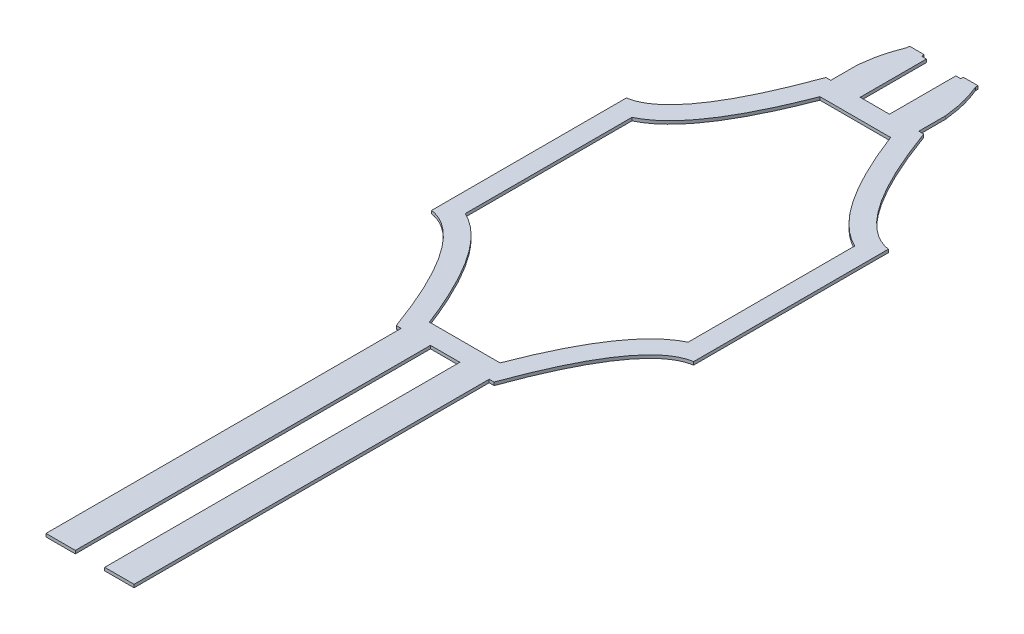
from build123d import *

# Parameters (mm, degrees)
BOSS_EXTRUDE1_DEPTH = 3.175


with BuildPart() as part:
    # Sketch2 → Boss-Extrude1 (new body)
    with BuildSketch(Plane(origin=(0, 0, 0), x_dir=(1, 0, 0), z_dir=(0, 1, 0))):
        with BuildLine():
            Line((133.879, -87.664110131), (133.879, 111.485889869))
            add(Edge.make_bspline(
                [(50, 231.485889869), (84.083748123, 137.245174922), (113.787224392, 114.335183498), (133.879, 111.485889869)],
                knots=[0.047958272, 0.047958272, 0.047958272, 0.047958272, 0.909985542, 0.909985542, 0.909985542, 0.909985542], degree=3))
            Line((50, 231.485889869), (45, 231.485889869))
            Line((45, 231.485889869), (45, 234.660889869))
            Line((45, 234.660889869), (45, 258.908417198))
            add(Edge.make_bspline(
                [(45, 258.908417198), (43.418997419, 270.483960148), (42.830467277, 279.607046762), (35, 299.285327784)],
                knots=[0, 0, 0, 0, 1, 1, 1, 1], degree=3))
            Line((35, 299.285327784), (35, 301.948248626))
            Line((35, 301.948248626), (20, 301.948248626))
            Line((20, 301.948248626), (20, 299.285327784))
            Line((20, 299.285327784), (15, 299.285327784))
            Line((15, 299.285327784), (15, 258.908417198))
            Line((15, 258.908417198), (15, 234.660889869))
            Line((15, 234.660889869), (15, 231.485889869))
            Line((15, 231.485889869), (-15, 231.485889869))
            Line((-15, 231.485889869), (-15, 234.660889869))
            Line((-15, 234.660889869), (-15, 258.908417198))
            Line((-15, 258.908417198), (-15, 299.285327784))
            Line((-15, 299.285327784), (-20, 299.285327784))
            Line((-20, 299.285327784), (-20, 301.948248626))
            Line((-20, 301.948248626), (-35, 301.948248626))
            Line((-35, 301.948248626), (-35, 299.285327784))
            add(Edge.make_bspline(
                [(-45, 258.908417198), (-43.418997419, 270.483960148), (-42.830467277, 279.607046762), (-35, 299.285327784)],
                knots=[0, 0, 0, 0, 1, 1, 1, 1], degree=3))
            Line((-45, 258.908417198), (-45, 234.660889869))
            Line((-45, 234.660889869), (-45, 231.485889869))
            Line((-45, 231.485889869), (-50, 231.485889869))
            add(Edge.make_bspline(
                [(-50, 231.485889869), (-84.083748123, 137.245174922), (-113.787224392, 114.335183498), (-133.879, 111.485889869)],
                knots=[0.047958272, 0.047958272, 0.047958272, 0.047958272, 0.909985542, 0.909985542, 0.909985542, 0.909985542], degree=3))
            Line((-133.879, 111.485889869), (-133.879, -87.664110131))
            add(Edge.make_bspline(
                [(-50, -207.664110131), (-84.083748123, -113.423395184), (-113.787224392, -90.51340376), (-133.879, -87.664110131)],
                knots=[0.047958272, 0.047958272, 0.047958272, 0.047958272, 0.909985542, 0.909985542, 0.909985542, 0.909985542], degree=3))
            Line((-50, -207.664110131), (-45, -207.664110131))
            Line((-45, -207.664110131), (-45, -570.664110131))
            Line((-45, -570.664110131), (-15, -570.664110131))
            Line((-15, -570.664110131), (-15, -207.664110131))
            Line((-15, -207.664110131), (15, -207.664110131))
            Line((15, -207.664110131), (15, -570.664110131))
            Line((15, -570.664110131), (45, -570.664110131))
            Line((45, -570.664110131), (45, -207.664110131))
            Line((45, -207.664110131), (50, -207.664110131))
            add(Edge.make_bspline(
                [(50, -207.664110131), (84.083748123, -113.423395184), (113.787224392, -90.51340376), (133.879, -87.664110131)],
                knots=[0.047958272, 0.047958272, 0.047958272, 0.047958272, 0.909985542, 0.909985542, 0.909985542, 0.909985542], degree=3))
        make_face()
        with BuildLine():
            Line((-36.109270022, 211.485889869), (36.109270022, 211.485889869))
            add(Edge.make_bspline(
                [(36.109270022, 211.485889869), (36.620900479, 210.153707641), (37.660122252, 207.473781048), (39.714730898, 202.278503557), (42.278666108, 195.985146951), (45.335862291, 188.77854064), (49.390820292, 179.606910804), (54.418132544, 168.945553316), (60.389126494, 157.365159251), (66.304447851, 146.928486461), (74.129976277, 134.446058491), (83.826330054, 121.360219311), (95.464860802, 109.191515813), (105.30850413, 101.694013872), (111.487440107, 98.217360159), (113.682320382, 97.13605795), (113.879, 97.040362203)],
                knots=[0.08850302, 0.08850302, 0.08850302, 0.08850302, 0.101338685, 0.114174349, 0.139845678, 0.165517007, 0.191188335, 0.242530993, 0.293873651, 0.345216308, 0.396558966, 0.499244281, 0.601929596, 0.704614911, 0.755957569, 0.761010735, 0.761010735, 0.761010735, 0.761010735], degree=3))
            Line((113.879, 97.040362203), (113.879, -73.218582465))
            add(Edge.make_bspline(
                [(36.109270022, -187.664110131), (36.620900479, -186.331927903), (37.660122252, -183.65200131), (39.714730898, -178.456723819), (42.278666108, -172.163367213), (45.335862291, -164.956760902), (49.390820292, -155.785131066), (54.418132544, -145.123773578), (60.389126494, -133.543379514), (66.304447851, -123.106706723), (74.129976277, -110.624278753), (83.826330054, -97.538439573), (95.464860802, -85.369736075), (105.30850413, -77.872234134), (111.487440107, -74.395580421), (113.682320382, -73.314278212), (113.879, -73.218582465)],
                knots=[0.08850302, 0.08850302, 0.08850302, 0.08850302, 0.101338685, 0.114174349, 0.139845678, 0.165517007, 0.191188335, 0.242530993, 0.293873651, 0.345216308, 0.396558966, 0.499244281, 0.601929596, 0.704614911, 0.755957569, 0.761010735, 0.761010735, 0.761010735, 0.761010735], degree=3))
            Line((36.109270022, -187.664110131), (-36.109270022, -187.664110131))
            add(Edge.make_bspline(
                [(-113.879, -73.218582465), (-113.682320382, -73.314278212), (-111.487440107, -74.395580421), (-105.30850413, -77.872234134), (-95.464860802, -85.369736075), (-83.826330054, -97.538439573), (-74.129976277, -110.624278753), (-66.304447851, -123.106706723), (-60.389126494, -133.543379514), (-54.418132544, -145.123773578), (-49.390820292, -155.785131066), (-45.335862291, -164.956760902), (-42.278666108, -172.163367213), (-39.714730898, -178.456723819), (-37.660122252, -183.65200131), (-36.620900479, -186.331927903), (-36.109270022, -187.664110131)],
                knots=[0.237477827, 0.237477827, 0.237477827, 0.237477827, 0.242530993, 0.293873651, 0.396558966, 0.499244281, 0.601929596, 0.653272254, 0.704614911, 0.755957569, 0.807300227, 0.832971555, 0.858642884, 0.884314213, 0.897149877, 0.909985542, 0.909985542, 0.909985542, 0.909985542], degree=3))
            Line((-113.879, -73.218582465), (-113.879, 97.040362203))
            add(Edge.make_bspline(
                [(-113.879, 97.040362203), (-113.682320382, 97.13605795), (-111.487440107, 98.217360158), (-105.30850413, 101.694013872), (-95.464860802, 109.191515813), (-83.826330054, 121.360219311), (-74.129976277, 134.446058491), (-66.304447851, 146.928486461), (-60.389126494, 157.365159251), (-54.418132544, 168.945553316), (-49.390820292, 179.606910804), (-45.335862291, 188.77854064), (-42.278666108, 195.985146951), (-39.714730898, 202.278503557), (-37.660122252, 207.473781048), (-36.620900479, 210.153707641), (-36.109270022, 211.485889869)],
                knots=[0.237477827, 0.237477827, 0.237477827, 0.237477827, 0.242530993, 0.293873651, 0.396558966, 0.499244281, 0.601929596, 0.653272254, 0.704614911, 0.755957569, 0.807300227, 0.832971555, 0.858642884, 0.884314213, 0.897149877, 0.909985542, 0.909985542, 0.909985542, 0.909985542], degree=3))
        make_face(mode=Mode.SUBTRACT)
    extrude(amount=BOSS_EXTRUDE1_DEPTH)


solid = part.part
